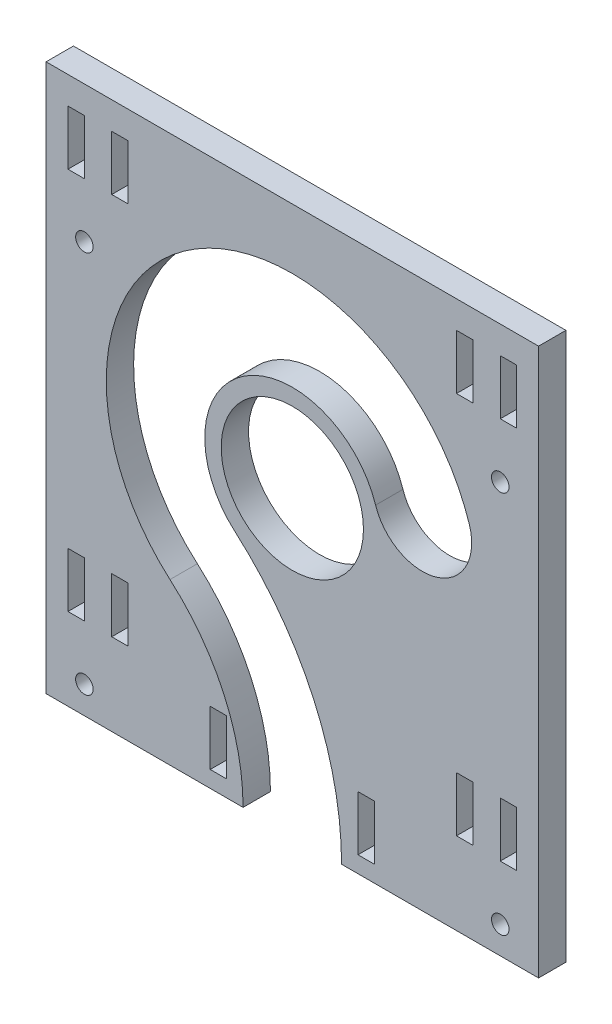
from build123d import *

# Parameters (mm, degrees)
EXTRUDE_2_DEPTH     = 5
SKETCH_4_R          = 13
CUT_EXTRUDE_1_DEPTH = 5
SKETCH_5_W          = 3
SKETCH_5_H          = 10
CUT_EXTRUDE_2_DEPTH = 5
SKETCH_6_R          = 1.6
SKETCH_6_W          = 3
SKETCH_6_H          = 10
CUT_EXTRUDE_3_DEPTH = 10


with BuildPart() as part:
    # Sketch 3 → Extrude 2 (new body)
    with BuildSketch(Plane.XY):
        with BuildLine():
            Line((45, 45), (-45, 45))
            Line((-45, 45), (-45, -45))
            Line((-45, -45), (-45, -55))
            Line((-45, -55), (-9, -55))
            ThreePointArc((-9, -55), (-12.495707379, -38.861685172), (-22.356164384, -25.616438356))
            ThreePointArc((-22.356164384, -25.616438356), (-18.738115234, 28.37046065), (32.335921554, 10.506577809))
            ThreePointArc((32.335921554, 10.506577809), (26.557565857, -0.834083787), (15.216904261, 4.94427191))
            ThreePointArc((15.216904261, 4.94427191), (-8.817936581, 13.350805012), (-10.520547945, -12.054794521))
            ThreePointArc((-10.520547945, -12.054794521), (3.890889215, -31.413232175), (9, -55))
            Line((9, -55), (45, -55))
            Line((45, -55), (45, -45))
            Line((45, -45), (45, 45))
        make_face()
    extrude(amount=EXTRUDE_2_DEPTH)

    # Sketch 4 → Cut-Extrude 1 (cut)
    with BuildSketch(Plane.XY.offset(5)):
        Circle(SKETCH_4_R)
    extrude(amount=-CUT_EXTRUDE_1_DEPTH, mode=Mode.SUBTRACT)

    # Sketch 5 → Cut-Extrude 2 (cut)
    with BuildSketch(Plane.XY.offset(5)):
        with Locations((-31.5, 35)):
            Rectangle(SKETCH_5_W, SKETCH_5_H)
        with Locations((31.5, 35)):
            Rectangle(SKETCH_5_W, SKETCH_5_H)
        with Locations((-31.5, -35)):
            Rectangle(SKETCH_5_W, SKETCH_5_H)
        with Locations((31.5, -35)):
            Rectangle(SKETCH_5_W, SKETCH_5_H)
    extrude(amount=-CUT_EXTRUDE_2_DEPTH, mode=Mode.SUBTRACT)

    # Sketch 6 → Cut-Extrude 3 (cut)
    with BuildSketch(Plane.XY.offset(5)):
        with Locations((-38, -50)):
            Circle(SKETCH_6_R)
        with Locations((38, -50)):
            Circle(SKETCH_6_R)
        with Locations((-38, 20)):
            Circle(SKETCH_6_R)
        with Locations((38, 20)):
            Circle(SKETCH_6_R)
        with Locations((-13.5, -47)):
            Rectangle(SKETCH_6_W, SKETCH_6_H)
        with Locations((13.5, -47)):
            Rectangle(SKETCH_6_W, SKETCH_6_H)
        with Locations((39.5, -35)):
            Rectangle(SKETCH_6_W, SKETCH_6_H)
        with Locations((39.5, 35)):
            Rectangle(SKETCH_6_W, SKETCH_6_H)
        with Locations((-39.5, 35)):
            Rectangle(SKETCH_6_W, SKETCH_6_H)
        with Locations((-39.5, -35)):
            Rectangle(SKETCH_6_W, SKETCH_6_H)
    extrude(amount=-CUT_EXTRUDE_3_DEPTH, mode=Mode.SUBTRACT)


solid = part.part
